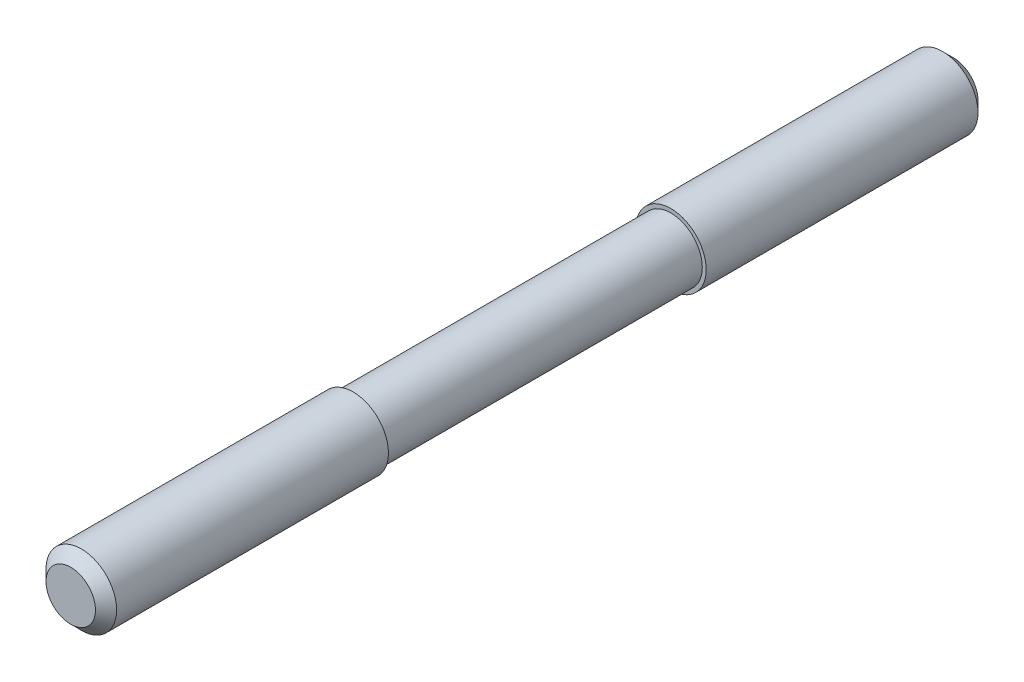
ISO-10303-21;
HEADER;
FILE_DESCRIPTION(('STEP AP214'),'2;1');
FILE_NAME('part.step','',(''),(''),'','','');
FILE_SCHEMA(('AUTOMOTIVE_DESIGN { 1 0 10303 214 1 1 1 1 }'));
ENDSEC;
DATA;
#1=APPLICATION_CONTEXT('core data for automotive mechanical design processes');
#2=APPLICATION_PROTOCOL_DEFINITION('international standard','automotive_design',2000,#1);
#3=PRODUCT_CONTEXT('',#1,'mechanical');
#4=PRODUCT('Part','Part','',(#3));
#5=PRODUCT_RELATED_PRODUCT_CATEGORY('part','',(#4));
#6=PRODUCT_DEFINITION_FORMATION('','',#4);
#7=PRODUCT_DEFINITION_CONTEXT('part definition',#1,'design');
#8=PRODUCT_DEFINITION('design','',#6,#7);
#9=PRODUCT_DEFINITION_SHAPE('','',#8);
#10=(LENGTH_UNIT() NAMED_UNIT(*) SI_UNIT(.MILLI.,.METRE.));
#11=(NAMED_UNIT(*) PLANE_ANGLE_UNIT() SI_UNIT($,.RADIAN.));
#12=(NAMED_UNIT(*) SI_UNIT($,.STERADIAN.) SOLID_ANGLE_UNIT());
#13=UNCERTAINTY_MEASURE_WITH_UNIT(LENGTH_MEASURE(1.E-05),#10,'distance_accuracy_value','');
#14=(GEOMETRIC_REPRESENTATION_CONTEXT(3) GLOBAL_UNCERTAINTY_ASSIGNED_CONTEXT((#13)) GLOBAL_UNIT_ASSIGNED_CONTEXT((#10,
#11,#12)) REPRESENTATION_CONTEXT('',''));
#15=CARTESIAN_POINT('',(0.,0.,0.));
#16=DIRECTION('',(0.,0.,1.));
#17=DIRECTION('',(1.,0.,0.));
#18=AXIS2_PLACEMENT_3D('',#15,#16,#17);
#19=CARTESIAN_POINT('',(0.,0.,0.));
#20=DIRECTION('',(0.,0.,1.));
#21=DIRECTION('',(1.,0.,0.));
#22=AXIS2_PLACEMENT_3D('',#19,#20,#21);
#23=PLANE('',#22);
#24=CARTESIAN_POINT('',(0.,0.,0.));
#25=DIRECTION('',(0.,0.,1.));
#26=DIRECTION('',(1.,0.,0.));
#27=AXIS2_PLACEMENT_3D('',#24,#25,#26);
#28=CIRCLE('',#27,3.5);
#29=CARTESIAN_POINT('',(3.5,0.,0.));
#30=VERTEX_POINT('',#29);
#31=EDGE_CURVE('E8',#30,#30,#28,.T.);
#32=ORIENTED_EDGE('',*,*,#31,.F.);
#33=EDGE_LOOP('',(#32));
#34=FACE_BOUND('',#33,.T.);
#35=ADVANCED_FACE('F12',(#34),#23,.F.);
#36=CARTESIAN_POINT('',(0.,0.,1.5));
#37=DIRECTION('',(0.,0.,1.));
#38=DIRECTION('',(1.,0.,0.));
#39=AXIS2_PLACEMENT_3D('',#36,#37,#38);
#40=CONICAL_SURFACE('',#39,5.,0.785398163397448);
#41=ORIENTED_EDGE('',*,*,#31,.T.);
#42=EDGE_LOOP('',(#41));
#43=FACE_BOUND('',#42,.T.);
#44=CARTESIAN_POINT('',(0.,0.,1.5));
#45=DIRECTION('',(0.,0.,1.));
#46=DIRECTION('',(1.,0.,0.));
#47=AXIS2_PLACEMENT_3D('',#44,#45,#46);
#48=CIRCLE('',#47,5.);
#49=CARTESIAN_POINT('',(5.,0.,1.5));
#50=VERTEX_POINT('',#49);
#51=EDGE_CURVE('E18',#50,#50,#48,.T.);
#52=ORIENTED_EDGE('',*,*,#51,.F.);
#53=EDGE_LOOP('',(#52));
#54=FACE_BOUND('',#53,.T.);
#55=ADVANCED_FACE('F62',(#43,#54),#40,.T.);
#56=CARTESIAN_POINT('',(0.,0.,70.));
#57=DIRECTION('',(0.,0.,1.));
#58=DIRECTION('',(1.,0.,0.));
#59=AXIS2_PLACEMENT_3D('',#56,#57,#58);
#60=CYLINDRICAL_SURFACE('',#59,5.);
#61=CARTESIAN_POINT('',(0.,0.,40.));
#62=DIRECTION('',(0.,0.,1.));
#63=DIRECTION('',(1.,0.,0.));
#64=AXIS2_PLACEMENT_3D('',#61,#62,#63);
#65=CIRCLE('',#64,5.);
#66=CARTESIAN_POINT('',(5.,0.,40.));
#67=VERTEX_POINT('',#66);
#68=EDGE_CURVE('E22',#67,#67,#65,.T.);
#69=ORIENTED_EDGE('',*,*,#68,.F.);
#70=EDGE_LOOP('',(#69));
#71=FACE_BOUND('',#70,.T.);
#72=ORIENTED_EDGE('',*,*,#51,.T.);
#73=EDGE_LOOP('',(#72));
#74=FACE_BOUND('',#73,.T.);
#75=ADVANCED_FACE('F68',(#71,#74),#60,.T.);
#76=CARTESIAN_POINT('',(5.,0.,40.));
#77=DIRECTION('',(0.,0.,-1.));
#78=DIRECTION('',(-1.,0.,0.));
#79=AXIS2_PLACEMENT_3D('',#76,#77,#78);
#80=PLANE('',#79);
#81=CARTESIAN_POINT('',(0.,0.,40.));
#82=DIRECTION('',(0.,0.,1.));
#83=DIRECTION('',(1.,0.,0.));
#84=AXIS2_PLACEMENT_3D('',#81,#82,#83);
#85=CIRCLE('',#84,4.45);
#86=CARTESIAN_POINT('',(4.45,0.,40.));
#87=VERTEX_POINT('',#86);
#88=EDGE_CURVE('E26',#87,#87,#85,.T.);
#89=ORIENTED_EDGE('',*,*,#88,.F.);
#90=EDGE_LOOP('',(#89));
#91=FACE_BOUND('',#90,.T.);
#92=ORIENTED_EDGE('',*,*,#68,.T.);
#93=EDGE_LOOP('',(#92));
#94=FACE_BOUND('',#93,.T.);
#95=ADVANCED_FACE('F73',(#91,#94),#80,.F.);
#96=CARTESIAN_POINT('',(0.,0.,70.));
#97=DIRECTION('',(0.,0.,1.));
#98=DIRECTION('',(1.,0.,0.));
#99=AXIS2_PLACEMENT_3D('',#96,#97,#98);
#100=CYLINDRICAL_SURFACE('',#99,4.45);
#101=CARTESIAN_POINT('',(0.,0.,85.));
#102=DIRECTION('',(0.,0.,1.));
#103=DIRECTION('',(1.,0.,0.));
#104=AXIS2_PLACEMENT_3D('',#101,#102,#103);
#105=CIRCLE('',#104,4.45);
#106=CARTESIAN_POINT('',(4.45,0.,85.));
#107=VERTEX_POINT('',#106);
#108=EDGE_CURVE('E31',#107,#107,#105,.T.);
#109=ORIENTED_EDGE('',*,*,#108,.F.);
#110=EDGE_LOOP('',(#109));
#111=FACE_BOUND('',#110,.T.);
#112=ORIENTED_EDGE('',*,*,#88,.T.);
#113=EDGE_LOOP('',(#112));
#114=FACE_BOUND('',#113,.T.);
#115=ADVANCED_FACE('F80',(#111,#114),#100,.T.);
#116=CARTESIAN_POINT('',(4.45,0.,85.));
#117=DIRECTION('',(0.,0.,1.));
#118=DIRECTION('',(1.,0.,0.));
#119=AXIS2_PLACEMENT_3D('',#116,#117,#118);
#120=PLANE('',#119);
#121=CARTESIAN_POINT('',(0.,0.,85.));
#122=DIRECTION('',(0.,0.,1.));
#123=DIRECTION('',(1.,0.,0.));
#124=AXIS2_PLACEMENT_3D('',#121,#122,#123);
#125=CIRCLE('',#124,5.);
#126=CARTESIAN_POINT('',(5.,0.,85.));
#127=VERTEX_POINT('',#126);
#128=EDGE_CURVE('E34',#127,#127,#125,.T.);
#129=ORIENTED_EDGE('',*,*,#128,.F.);
#130=EDGE_LOOP('',(#129));
#131=FACE_BOUND('',#130,.T.);
#132=ORIENTED_EDGE('',*,*,#108,.T.);
#133=EDGE_LOOP('',(#132));
#134=FACE_BOUND('',#133,.T.);
#135=ADVANCED_FACE('F58',(#131,#134),#120,.F.);
#136=CARTESIAN_POINT('',(0.,0.,70.));
#137=DIRECTION('',(0.,0.,1.));
#138=DIRECTION('',(1.,0.,0.));
#139=AXIS2_PLACEMENT_3D('',#136,#137,#138);
#140=CYLINDRICAL_SURFACE('',#139,5.);
#141=CARTESIAN_POINT('',(0.,0.,123.5));
#142=DIRECTION('',(0.,0.,1.));
#143=DIRECTION('',(1.,0.,0.));
#144=AXIS2_PLACEMENT_3D('',#141,#142,#143);
#145=CIRCLE('',#144,5.);
#146=CARTESIAN_POINT('',(5.,0.,123.5));
#147=VERTEX_POINT('',#146);
#148=EDGE_CURVE('E37',#147,#147,#145,.T.);
#149=ORIENTED_EDGE('',*,*,#148,.F.);
#150=EDGE_LOOP('',(#149));
#151=FACE_BOUND('',#150,.T.);
#152=ORIENTED_EDGE('',*,*,#128,.T.);
#153=EDGE_LOOP('',(#152));
#154=FACE_BOUND('',#153,.T.);
#155=ADVANCED_FACE('F48',(#151,#154),#140,.T.);
#156=CARTESIAN_POINT('',(0.,0.,125.));
#157=DIRECTION('',(0.,0.,-1.));
#158=DIRECTION('',(-1.,0.,0.));
#159=AXIS2_PLACEMENT_3D('',#156,#157,#158);
#160=CONICAL_SURFACE('',#159,3.5,0.785398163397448);
#161=ORIENTED_EDGE('',*,*,#148,.T.);
#162=EDGE_LOOP('',(#161));
#163=FACE_BOUND('',#162,.T.);
#164=CARTESIAN_POINT('',(0.,0.,125.));
#165=DIRECTION('',(0.,0.,1.));
#166=DIRECTION('',(1.,0.,0.));
#167=AXIS2_PLACEMENT_3D('',#164,#165,#166);
#168=CIRCLE('',#167,3.5);
#169=CARTESIAN_POINT('',(3.5,0.,125.));
#170=VERTEX_POINT('',#169);
#171=EDGE_CURVE('E40',#170,#170,#168,.T.);
#172=ORIENTED_EDGE('',*,*,#171,.F.);
#173=EDGE_LOOP('',(#172));
#174=FACE_BOUND('',#173,.T.);
#175=ADVANCED_FACE('F46',(#163,#174),#160,.T.);
#176=CARTESIAN_POINT('',(3.5,0.,125.));
#177=DIRECTION('',(0.,0.,-1.));
#178=DIRECTION('',(-1.,0.,0.));
#179=AXIS2_PLACEMENT_3D('',#176,#177,#178);
#180=PLANE('',#179);
#181=ORIENTED_EDGE('',*,*,#171,.T.);
#182=EDGE_LOOP('',(#181));
#183=FACE_BOUND('',#182,.T.);
#184=ADVANCED_FACE('F44',(#183),#180,.F.);
#185=CLOSED_SHELL('',(#35,#55,#75,#95,#115,#135,#155,#175,#184));
#186=MANIFOLD_SOLID_BREP('B1',#185);
#187=ADVANCED_BREP_SHAPE_REPRESENTATION('',(#18,#186),#14);
#188=SHAPE_DEFINITION_REPRESENTATION(#9,#187);
ENDSEC;
END-ISO-10303-21;
